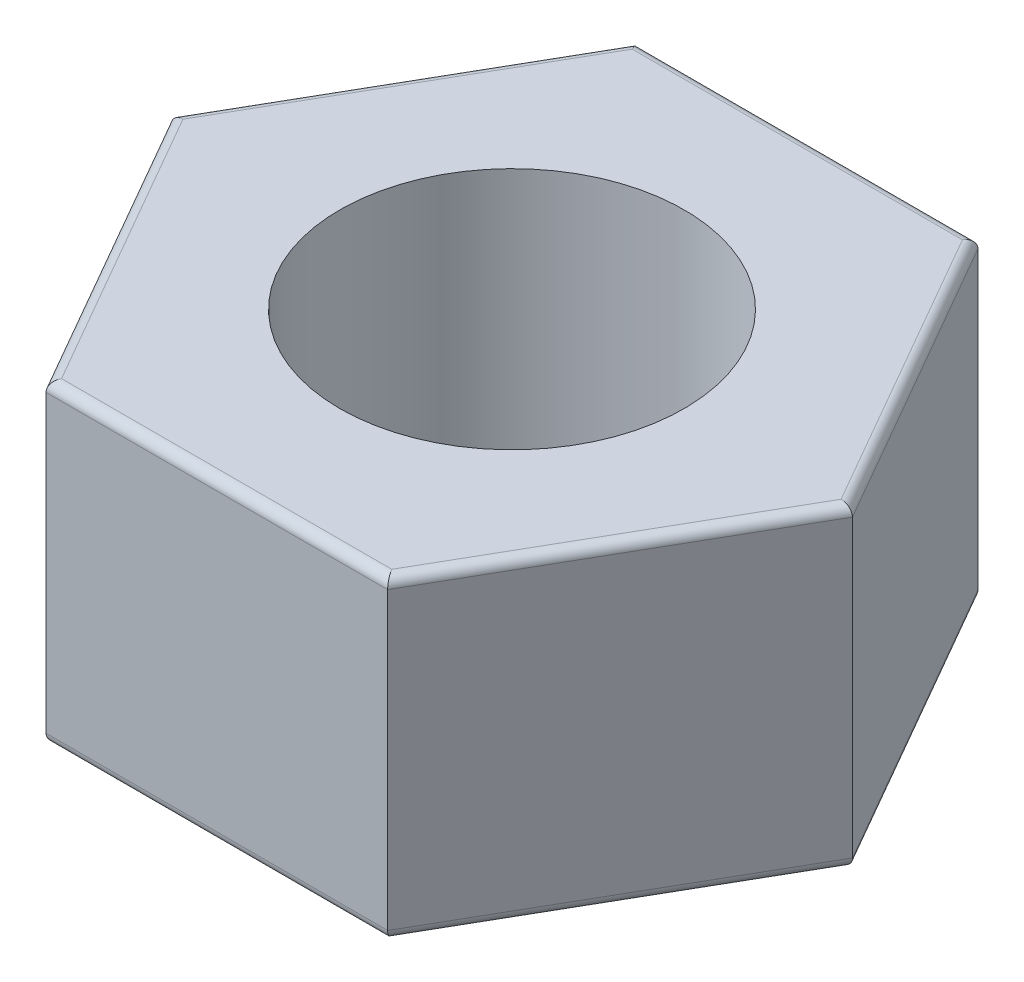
ISO-10303-21;
HEADER;
FILE_DESCRIPTION(('STEP AP214'),'2;1');
FILE_NAME('part.step','',(''),(''),'','','');
FILE_SCHEMA(('AUTOMOTIVE_DESIGN { 1 0 10303 214 1 1 1 1 }'));
ENDSEC;
DATA;
#1=APPLICATION_CONTEXT('core data for automotive mechanical design processes');
#2=APPLICATION_PROTOCOL_DEFINITION('international standard','automotive_design',2000,#1);
#3=PRODUCT_CONTEXT('',#1,'mechanical');
#4=PRODUCT('Part','Part','',(#3));
#5=PRODUCT_RELATED_PRODUCT_CATEGORY('part','',(#4));
#6=PRODUCT_DEFINITION_FORMATION('','',#4);
#7=PRODUCT_DEFINITION_CONTEXT('part definition',#1,'design');
#8=PRODUCT_DEFINITION('design','',#6,#7);
#9=PRODUCT_DEFINITION_SHAPE('','',#8);
#10=(LENGTH_UNIT() NAMED_UNIT(*) SI_UNIT(.MILLI.,.METRE.));
#11=(NAMED_UNIT(*) PLANE_ANGLE_UNIT() SI_UNIT($,.RADIAN.));
#12=(NAMED_UNIT(*) SI_UNIT($,.STERADIAN.) SOLID_ANGLE_UNIT());
#13=UNCERTAINTY_MEASURE_WITH_UNIT(LENGTH_MEASURE(1.E-05),#10,'distance_accuracy_value','');
#14=(GEOMETRIC_REPRESENTATION_CONTEXT(3) GLOBAL_UNCERTAINTY_ASSIGNED_CONTEXT((#13)) GLOBAL_UNIT_ASSIGNED_CONTEXT((#10,
#11,#12)) REPRESENTATION_CONTEXT('',''));
#15=CARTESIAN_POINT('',(0.,0.,0.));
#16=DIRECTION('',(0.,0.,1.));
#17=DIRECTION('',(1.,0.,0.));
#18=AXIS2_PLACEMENT_3D('',#15,#16,#17);
#19=CARTESIAN_POINT('',(8.68083530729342,16.,15.));
#20=DIRECTION('',(0.,1.,0.));
#21=DIRECTION('',(0.,0.,1.));
#22=AXIS2_PLACEMENT_3D('',#19,#20,#21);
#23=PLANE('',#22);
#24=DIRECTION('',(-0.498217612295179,0.,0.867052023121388));
#25=VECTOR('',#24,1.);
#26=CARTESIAN_POINT('',(-16.8664739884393,16.,0.249108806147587));
#27=LINE('',#26,#25);
#28=CARTESIAN_POINT('',(-8.39147413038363,16.,-14.5));
#29=VERTEX_POINT('',#28);
#30=CARTESIAN_POINT('',(-16.7233333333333,16.,0.));
#31=VERTEX_POINT('',#30);
#32=EDGE_CURVE('E38',#29,#31,#27,.T.);
#33=ORIENTED_EDGE('',*,*,#32,.T.);
#34=DIRECTION('',(0.498217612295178,0.,0.867052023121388));
#35=VECTOR('',#34,1.);
#36=CARTESIAN_POINT('',(-8.24730929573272,16.,14.7508911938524));
#37=LINE('',#36,#35);
#38=CARTESIAN_POINT('',(-8.39147413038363,16.,14.5));
#39=VERTEX_POINT('',#38);
#40=EDGE_CURVE('E11',#31,#39,#37,.T.);
#41=ORIENTED_EDGE('',*,*,#40,.T.);
#42=DIRECTION('',(1.,0.,0.));
#43=VECTOR('',#42,1.);
#44=CARTESIAN_POINT('',(8.68083530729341,16.,14.5));
#45=LINE('',#44,#43);
#46=CARTESIAN_POINT('',(8.39147413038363,16.,14.5));
#47=VERTEX_POINT('',#46);
#48=EDGE_CURVE('E152',#39,#47,#45,.T.);
#49=ORIENTED_EDGE('',*,*,#48,.T.);
#50=DIRECTION('',(0.498217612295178,0.,-0.867052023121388));
#51=VECTOR('',#50,1.);
#52=CARTESIAN_POINT('',(16.8664739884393,16.,-0.249108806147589));
#53=LINE('',#52,#51);
#54=CARTESIAN_POINT('',(16.7233333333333,16.,0.));
#55=VERTEX_POINT('',#54);
#56=EDGE_CURVE('E230',#47,#55,#53,.T.);
#57=ORIENTED_EDGE('',*,*,#56,.T.);
#58=DIRECTION('',(-0.498217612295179,0.,-0.867052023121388));
#59=VECTOR('',#58,1.);
#60=CARTESIAN_POINT('',(8.24730929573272,16.,-14.7508911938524));
#61=LINE('',#60,#59);
#62=CARTESIAN_POINT('',(8.39147413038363,16.,-14.5));
#63=VERTEX_POINT('',#62);
#64=EDGE_CURVE('E232',#55,#63,#61,.T.);
#65=ORIENTED_EDGE('',*,*,#64,.T.);
#66=DIRECTION('',(-1.,0.,0.));
#67=VECTOR('',#66,1.);
#68=CARTESIAN_POINT('',(-8.68083530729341,16.,-14.5));
#69=LINE('',#68,#67);
#70=EDGE_CURVE('E48',#63,#29,#69,.T.);
#71=ORIENTED_EDGE('',*,*,#70,.T.);
#72=EDGE_LOOP('',(#33,#41,#49,#57,#65,#71));
#73=FACE_BOUND('',#72,.T.);
#74=CARTESIAN_POINT('',(0.,16.,0.));
#75=DIRECTION('',(0.,1.,0.));
#76=DIRECTION('',(0.,0.,1.));
#77=AXIS2_PLACEMENT_3D('',#74,#75,#76);
#78=CIRCLE('',#77,8.75);
#79=CARTESIAN_POINT('',(0.,16.,8.75));
#80=VERTEX_POINT('',#79);
#81=EDGE_CURVE('E141',#80,#80,#78,.T.);
#82=ORIENTED_EDGE('',*,*,#81,.F.);
#83=EDGE_LOOP('',(#82));
#84=FACE_BOUND('',#83,.T.);
#85=ADVANCED_FACE('F30',(#73,#84),#23,.T.);
#86=CARTESIAN_POINT('',(8.68083530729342,0.,15.));
#87=DIRECTION('',(0.,1.,0.));
#88=DIRECTION('',(0.,0.,1.));
#89=AXIS2_PLACEMENT_3D('',#86,#87,#88);
#90=PLANE('',#89);
#91=DIRECTION('',(1.,0.,0.));
#92=VECTOR('',#91,1.);
#93=CARTESIAN_POINT('',(8.68083530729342,0.,14.5));
#94=LINE('',#93,#92);
#95=CARTESIAN_POINT('',(8.39147413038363,0.,14.5));
#96=VERTEX_POINT('',#95);
#97=CARTESIAN_POINT('',(-8.39147413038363,0.,14.5));
#98=VERTEX_POINT('',#97);
#99=EDGE_CURVE('E200',#96,#98,#94,.F.);
#100=ORIENTED_EDGE('',*,*,#99,.T.);
#101=DIRECTION('',(0.498217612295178,0.,0.867052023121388));
#102=VECTOR('',#101,1.);
#103=CARTESIAN_POINT('',(-3.93778171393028,0.,22.2507958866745));
#104=LINE('',#103,#102);
#105=CARTESIAN_POINT('',(-16.7233333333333,0.,0.));
#106=VERTEX_POINT('',#105);
#107=EDGE_CURVE('E210',#98,#106,#104,.F.);
#108=ORIENTED_EDGE('',*,*,#107,.T.);
#109=DIRECTION('',(-0.498217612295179,0.,0.867052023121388));
#110=VECTOR('',#109,1.);
#111=CARTESIAN_POINT('',(-16.8971993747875,0.,0.302580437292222));
#112=LINE('',#111,#110);
#113=CARTESIAN_POINT('',(-8.39147413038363,0.,-14.5));
#114=VERTEX_POINT('',#113);
#115=EDGE_CURVE('E208',#106,#114,#112,.F.);
#116=ORIENTED_EDGE('',*,*,#115,.T.);
#117=DIRECTION('',(-1.,0.,0.));
#118=VECTOR('',#117,1.);
#119=CARTESIAN_POINT('',(8.68083530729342,0.,-14.5));
#120=LINE('',#119,#118);
#121=CARTESIAN_POINT('',(8.39147413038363,0.,-14.5));
#122=VERTEX_POINT('',#121);
#123=EDGE_CURVE('E206',#114,#122,#120,.F.);
#124=ORIENTED_EDGE('',*,*,#123,.T.);
#125=DIRECTION('',(-0.498217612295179,0.,-0.867052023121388));
#126=VECTOR('',#125,1.);
#127=CARTESIAN_POINT('',(21.20672695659,0.,7.80248513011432));
#128=LINE('',#127,#126);
#129=CARTESIAN_POINT('',(16.7233333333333,0.,0.));
#130=VERTEX_POINT('',#129);
#131=EDGE_CURVE('E204',#122,#130,#128,.F.);
#132=ORIENTED_EDGE('',*,*,#131,.T.);
#133=DIRECTION('',(0.498217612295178,0.,-0.867052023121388));
#134=VECTOR('',#133,1.);
#135=CARTESIAN_POINT('',(8.24730929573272,0.,14.7508911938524));
#136=LINE('',#135,#134);
#137=EDGE_CURVE('E202',#130,#96,#136,.F.);
#138=ORIENTED_EDGE('',*,*,#137,.T.);
#139=EDGE_LOOP('',(#100,#108,#116,#124,#132,#138));
#140=FACE_BOUND('',#139,.T.);
#141=CARTESIAN_POINT('',(0.,0.,0.));
#142=DIRECTION('',(0.,1.,0.));
#143=DIRECTION('',(0.,0.,1.));
#144=AXIS2_PLACEMENT_3D('',#141,#142,#143);
#145=CIRCLE('',#144,8.75);
#146=CARTESIAN_POINT('',(0.,0.,8.75));
#147=VERTEX_POINT('',#146);
#148=EDGE_CURVE('E183',#147,#147,#145,.T.);
#149=ORIENTED_EDGE('',*,*,#148,.T.);
#150=EDGE_LOOP('',(#149));
#151=FACE_BOUND('',#150,.T.);
#152=ADVANCED_FACE('F270',(#140,#151),#90,.F.);
#153=CARTESIAN_POINT('',(-8.68083530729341,16.,15.));
#154=DIRECTION('',(0.,0.,-1.));
#155=DIRECTION('',(-1.,0.,0.));
#156=AXIS2_PLACEMENT_3D('',#153,#154,#155);
#157=PLANE('',#156);
#158=DIRECTION('',(0.,-1.,0.));
#159=VECTOR('',#158,1.);
#160=CARTESIAN_POINT('',(-8.68083530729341,16.,15.));
#161=LINE('',#160,#159);
#162=CARTESIAN_POINT('',(-8.68083530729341,15.5,15.));
#163=VERTEX_POINT('',#162);
#164=CARTESIAN_POINT('',(-8.68083530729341,0.5,15.));
#165=VERTEX_POINT('',#164);
#166=EDGE_CURVE('E120',#163,#165,#161,.T.);
#167=ORIENTED_EDGE('',*,*,#166,.T.);
#168=DIRECTION('',(1.,0.,0.));
#169=VECTOR('',#168,1.);
#170=CARTESIAN_POINT('',(-8.68083530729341,0.5,15.));
#171=LINE('',#170,#169);
#172=CARTESIAN_POINT('',(8.68083530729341,0.5,15.));
#173=VERTEX_POINT('',#172);
#174=EDGE_CURVE('E127',#165,#173,#171,.T.);
#175=ORIENTED_EDGE('',*,*,#174,.T.);
#176=DIRECTION('',(0.,-1.,0.));
#177=VECTOR('',#176,1.);
#178=CARTESIAN_POINT('',(8.68083530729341,16.,15.));
#179=LINE('',#178,#177);
#180=CARTESIAN_POINT('',(8.68083530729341,15.5,15.));
#181=VERTEX_POINT('',#180);
#182=EDGE_CURVE('E122',#181,#173,#179,.T.);
#183=ORIENTED_EDGE('',*,*,#182,.F.);
#184=DIRECTION('',(1.,0.,0.));
#185=VECTOR('',#184,1.);
#186=CARTESIAN_POINT('',(-8.68083530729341,15.5,15.));
#187=LINE('',#186,#185);
#188=EDGE_CURVE('E118',#181,#163,#187,.F.);
#189=ORIENTED_EDGE('',*,*,#188,.T.);
#190=EDGE_LOOP('',(#167,#175,#183,#189));
#191=FACE_BOUND('',#190,.T.);
#192=ADVANCED_FACE('F32',(#191),#157,.F.);
#193=CARTESIAN_POINT('',(8.68083530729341,16.,15.));
#194=DIRECTION('',(-0.867052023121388,0.,-0.498217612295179));
#195=DIRECTION('',(-0.498217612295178,0.,0.867052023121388));
#196=AXIS2_PLACEMENT_3D('',#193,#194,#195);
#197=PLANE('',#196);
#198=ORIENTED_EDGE('',*,*,#182,.T.);
#199=DIRECTION('',(0.498217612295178,0.,-0.867052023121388));
#200=VECTOR('',#199,1.);
#201=CARTESIAN_POINT('',(8.68083530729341,0.5,15.));
#202=LINE('',#201,#200);
#203=CARTESIAN_POINT('',(17.3,0.5,0.));
#204=VERTEX_POINT('',#203);
#205=EDGE_CURVE('E128',#173,#204,#202,.T.);
#206=ORIENTED_EDGE('',*,*,#205,.T.);
#207=DIRECTION('',(0.,-1.,0.));
#208=VECTOR('',#207,1.);
#209=CARTESIAN_POINT('',(17.3,16.,0.));
#210=LINE('',#209,#208);
#211=CARTESIAN_POINT('',(17.3,15.5,0.));
#212=VERTEX_POINT('',#211);
#213=EDGE_CURVE('E195',#212,#204,#210,.T.);
#214=ORIENTED_EDGE('',*,*,#213,.F.);
#215=DIRECTION('',(0.498217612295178,0.,-0.867052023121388));
#216=VECTOR('',#215,1.);
#217=CARTESIAN_POINT('',(8.68083530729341,15.5,15.));
#218=LINE('',#217,#216);
#219=EDGE_CURVE('E225',#212,#181,#218,.F.);
#220=ORIENTED_EDGE('',*,*,#219,.T.);
#221=EDGE_LOOP('',(#198,#206,#214,#220));
#222=FACE_BOUND('',#221,.T.);
#223=ADVANCED_FACE('F252',(#222),#197,.F.);
#224=CARTESIAN_POINT('',(8.68083530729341,16.,-15.));
#225=DIRECTION('',(-0.867052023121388,0.,0.498217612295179));
#226=DIRECTION('',(0.498217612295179,0.,0.867052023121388));
#227=AXIS2_PLACEMENT_3D('',#224,#225,#226);
#228=PLANE('',#227);
#229=ORIENTED_EDGE('',*,*,#213,.T.);
#230=DIRECTION('',(-0.498217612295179,0.,-0.867052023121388));
#231=VECTOR('',#230,1.);
#232=CARTESIAN_POINT('',(8.68083530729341,0.5,-15.));
#233=LINE('',#232,#231);
#234=CARTESIAN_POINT('',(8.68083530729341,0.5,-15.));
#235=VERTEX_POINT('',#234);
#236=EDGE_CURVE('E223',#204,#235,#233,.T.);
#237=ORIENTED_EDGE('',*,*,#236,.T.);
#238=DIRECTION('',(0.,-1.,0.));
#239=VECTOR('',#238,1.);
#240=CARTESIAN_POINT('',(8.68083530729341,16.,-15.));
#241=LINE('',#240,#239);
#242=CARTESIAN_POINT('',(8.68083530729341,15.5,-15.));
#243=VERTEX_POINT('',#242);
#244=EDGE_CURVE('E192',#243,#235,#241,.T.);
#245=ORIENTED_EDGE('',*,*,#244,.F.);
#246=DIRECTION('',(-0.498217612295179,0.,-0.867052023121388));
#247=VECTOR('',#246,1.);
#248=CARTESIAN_POINT('',(17.3,15.5,0.));
#249=LINE('',#248,#247);
#250=EDGE_CURVE('E221',#243,#212,#249,.F.);
#251=ORIENTED_EDGE('',*,*,#250,.T.);
#252=EDGE_LOOP('',(#229,#237,#245,#251));
#253=FACE_BOUND('',#252,.T.);
#254=ADVANCED_FACE('F256',(#253),#228,.F.);
#255=CARTESIAN_POINT('',(-8.68083530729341,16.,-15.));
#256=DIRECTION('',(0.,0.,1.));
#257=DIRECTION('',(1.,0.,0.));
#258=AXIS2_PLACEMENT_3D('',#255,#256,#257);
#259=PLANE('',#258);
#260=ORIENTED_EDGE('',*,*,#244,.T.);
#261=DIRECTION('',(-1.,0.,0.));
#262=VECTOR('',#261,1.);
#263=CARTESIAN_POINT('',(-8.68083530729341,0.5,-15.));
#264=LINE('',#263,#262);
#265=CARTESIAN_POINT('',(-8.68083530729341,0.5,-15.));
#266=VERTEX_POINT('',#265);
#267=EDGE_CURVE('E219',#235,#266,#264,.T.);
#268=ORIENTED_EDGE('',*,*,#267,.T.);
#269=DIRECTION('',(0.,-1.,0.));
#270=VECTOR('',#269,1.);
#271=CARTESIAN_POINT('',(-8.68083530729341,16.,-15.));
#272=LINE('',#271,#270);
#273=CARTESIAN_POINT('',(-8.68083530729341,15.5,-15.));
#274=VERTEX_POINT('',#273);
#275=EDGE_CURVE('E189',#274,#266,#272,.T.);
#276=ORIENTED_EDGE('',*,*,#275,.F.);
#277=DIRECTION('',(-1.,0.,0.));
#278=VECTOR('',#277,1.);
#279=CARTESIAN_POINT('',(8.68083530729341,15.5,-15.));
#280=LINE('',#279,#278);
#281=EDGE_CURVE('E217',#274,#243,#280,.F.);
#282=ORIENTED_EDGE('',*,*,#281,.T.);
#283=EDGE_LOOP('',(#260,#268,#276,#282));
#284=FACE_BOUND('',#283,.T.);
#285=ADVANCED_FACE('F280',(#284),#259,.F.);
#286=CARTESIAN_POINT('',(-8.68083530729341,16.,-15.));
#287=DIRECTION('',(0.867052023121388,0.,0.498217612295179));
#288=DIRECTION('',(0.498217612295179,0.,-0.867052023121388));
#289=AXIS2_PLACEMENT_3D('',#286,#287,#288);
#290=PLANE('',#289);
#291=ORIENTED_EDGE('',*,*,#275,.T.);
#292=DIRECTION('',(-0.498217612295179,0.,0.867052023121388));
#293=VECTOR('',#292,1.);
#294=CARTESIAN_POINT('',(-8.68083530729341,0.5,-15.));
#295=LINE('',#294,#293);
#296=CARTESIAN_POINT('',(-17.3,0.5,0.));
#297=VERTEX_POINT('',#296);
#298=EDGE_CURVE('E215',#266,#297,#295,.T.);
#299=ORIENTED_EDGE('',*,*,#298,.T.);
#300=DIRECTION('',(0.,-1.,0.));
#301=VECTOR('',#300,1.);
#302=CARTESIAN_POINT('',(-17.3,16.,0.));
#303=LINE('',#302,#301);
#304=CARTESIAN_POINT('',(-17.3,15.5,0.));
#305=VERTEX_POINT('',#304);
#306=EDGE_CURVE('E140',#305,#297,#303,.T.);
#307=ORIENTED_EDGE('',*,*,#306,.F.);
#308=DIRECTION('',(-0.498217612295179,0.,0.867052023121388));
#309=VECTOR('',#308,1.);
#310=CARTESIAN_POINT('',(-8.68083530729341,15.5,-15.));
#311=LINE('',#310,#309);
#312=EDGE_CURVE('E213',#305,#274,#311,.F.);
#313=ORIENTED_EDGE('',*,*,#312,.T.);
#314=EDGE_LOOP('',(#291,#299,#307,#313));
#315=FACE_BOUND('',#314,.T.);
#316=ADVANCED_FACE('F282',(#315),#290,.F.);
#317=CARTESIAN_POINT('',(-8.68083530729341,16.,15.));
#318=DIRECTION('',(0.867052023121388,0.,-0.498217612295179));
#319=DIRECTION('',(-0.498217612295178,0.,-0.867052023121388));
#320=AXIS2_PLACEMENT_3D('',#317,#318,#319);
#321=PLANE('',#320);
#322=ORIENTED_EDGE('',*,*,#306,.T.);
#323=DIRECTION('',(0.498217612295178,0.,0.867052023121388));
#324=VECTOR('',#323,1.);
#325=CARTESIAN_POINT('',(-8.68083530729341,0.5,15.));
#326=LINE('',#325,#324);
#327=EDGE_CURVE('E139',#297,#165,#326,.T.);
#328=ORIENTED_EDGE('',*,*,#327,.T.);
#329=ORIENTED_EDGE('',*,*,#166,.F.);
#330=DIRECTION('',(0.498217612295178,0.,0.867052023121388));
#331=VECTOR('',#330,1.);
#332=CARTESIAN_POINT('',(-17.3,15.5,0.));
#333=LINE('',#332,#331);
#334=EDGE_CURVE('E136',#163,#305,#333,.F.);
#335=ORIENTED_EDGE('',*,*,#334,.T.);
#336=EDGE_LOOP('',(#322,#328,#329,#335));
#337=FACE_BOUND('',#336,.T.);
#338=ADVANCED_FACE('F135',(#337),#321,.F.);
#339=CARTESIAN_POINT('',(0.,16.,0.));
#340=DIRECTION('',(0.,-1.,0.));
#341=DIRECTION('',(0.,0.,-1.));
#342=AXIS2_PLACEMENT_3D('',#339,#340,#341);
#343=CYLINDRICAL_SURFACE('',#342,8.75);
#344=ORIENTED_EDGE('',*,*,#81,.T.);
#345=EDGE_LOOP('',(#344));
#346=FACE_BOUND('',#345,.T.);
#347=ORIENTED_EDGE('',*,*,#148,.F.);
#348=EDGE_LOOP('',(#347));
#349=FACE_BOUND('',#348,.T.);
#350=ADVANCED_FACE('F311',(#346,#349),#343,.F.);
#351=CARTESIAN_POINT('',(8.24730929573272,0.5,-14.7508911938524));
#352=DIRECTION('',(-0.498217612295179,0.,-0.867052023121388));
#353=DIRECTION('',(-0.867052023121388,0.,0.498217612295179));
#354=AXIS2_PLACEMENT_3D('',#351,#352,#353);
#355=CYLINDRICAL_SURFACE('',#354,0.5);
#356=CARTESIAN_POINT('',(16.7233333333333,0.5,0.));
#357=DIRECTION('',(0.,0.,-1.));
#358=DIRECTION('',(1.,0.,0.));
#359=AXIS2_PLACEMENT_3D('',#356,#357,#358);
#360=ELLIPSE('',#359,0.576666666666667,0.5);
#361=EDGE_CURVE('E177',#130,#204,#360,.F.);
#362=ORIENTED_EDGE('',*,*,#361,.F.);
#363=ORIENTED_EDGE('',*,*,#131,.F.);
#364=CARTESIAN_POINT('',(8.39147413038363,0.5,-14.5));
#365=DIRECTION('',(-0.865510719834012,0.,-0.500890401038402));
#366=DIRECTION('',(0.500890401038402,0.,-0.865510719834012));
#367=AXIS2_PLACEMENT_3D('',#364,#365,#366);
#368=ELLIPSE('',#367,0.57769359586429,0.5);
#369=EDGE_CURVE('E180',#235,#122,#368,.T.);
#370=ORIENTED_EDGE('',*,*,#369,.F.);
#371=ORIENTED_EDGE('',*,*,#236,.F.);
#372=EDGE_LOOP('',(#362,#363,#370,#371));
#373=FACE_BOUND('',#372,.T.);
#374=ADVANCED_FACE('F261',(#373),#355,.T.);
#375=CARTESIAN_POINT('',(-8.68083530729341,0.5,-14.5));
#376=DIRECTION('',(-1.,0.,0.));
#377=DIRECTION('',(0.,0.,1.));
#378=AXIS2_PLACEMENT_3D('',#375,#376,#377);
#379=CYLINDRICAL_SURFACE('',#378,0.5);
#380=ORIENTED_EDGE('',*,*,#369,.T.);
#381=ORIENTED_EDGE('',*,*,#123,.F.);
#382=CARTESIAN_POINT('',(-8.39147413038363,0.5,-14.5));
#383=DIRECTION('',(-0.865510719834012,0.,0.500890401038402));
#384=DIRECTION('',(-0.500890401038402,0.,-0.865510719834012));
#385=AXIS2_PLACEMENT_3D('',#382,#383,#384);
#386=ELLIPSE('',#385,0.57769359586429,0.5);
#387=EDGE_CURVE('E174',#266,#114,#386,.T.);
#388=ORIENTED_EDGE('',*,*,#387,.F.);
#389=ORIENTED_EDGE('',*,*,#267,.F.);
#390=EDGE_LOOP('',(#380,#381,#388,#389));
#391=FACE_BOUND('',#390,.T.);
#392=ADVANCED_FACE('F275',(#391),#379,.T.);
#393=CARTESIAN_POINT('',(8.24730929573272,0.5,14.7508911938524));
#394=DIRECTION('',(0.498217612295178,0.,-0.867052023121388));
#395=DIRECTION('',(-0.867052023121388,0.,-0.498217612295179));
#396=AXIS2_PLACEMENT_3D('',#393,#394,#395);
#397=CYLINDRICAL_SURFACE('',#396,0.5);
#398=ORIENTED_EDGE('',*,*,#361,.T.);
#399=ORIENTED_EDGE('',*,*,#205,.F.);
#400=CARTESIAN_POINT('',(8.39147413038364,0.5,14.5));
#401=DIRECTION('',(0.865510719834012,0.,-0.500890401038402));
#402=DIRECTION('',(0.500890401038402,0.,0.865510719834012));
#403=AXIS2_PLACEMENT_3D('',#400,#401,#402);
#404=ELLIPSE('',#403,0.57769359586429,0.5);
#405=EDGE_CURVE('E171',#96,#173,#404,.F.);
#406=ORIENTED_EDGE('',*,*,#405,.F.);
#407=ORIENTED_EDGE('',*,*,#137,.F.);
#408=EDGE_LOOP('',(#398,#399,#406,#407));
#409=FACE_BOUND('',#408,.T.);
#410=ADVANCED_FACE('F266',(#409),#397,.T.);
#411=CARTESIAN_POINT('',(-8.24730929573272,0.5,-14.7508911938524));
#412=DIRECTION('',(-0.498217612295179,0.,0.867052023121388));
#413=DIRECTION('',(0.867052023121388,0.,0.498217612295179));
#414=AXIS2_PLACEMENT_3D('',#411,#412,#413);
#415=CYLINDRICAL_SURFACE('',#414,0.5);
#416=ORIENTED_EDGE('',*,*,#387,.T.);
#417=ORIENTED_EDGE('',*,*,#115,.F.);
#418=CARTESIAN_POINT('',(-16.7233333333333,0.5,0.));
#419=DIRECTION('',(0.,0.,1.));
#420=DIRECTION('',(-1.,0.,0.));
#421=AXIS2_PLACEMENT_3D('',#418,#419,#420);
#422=ELLIPSE('',#421,0.576666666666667,0.5);
#423=EDGE_CURVE('E169',#297,#106,#422,.T.);
#424=ORIENTED_EDGE('',*,*,#423,.F.);
#425=ORIENTED_EDGE('',*,*,#298,.F.);
#426=EDGE_LOOP('',(#416,#417,#424,#425));
#427=FACE_BOUND('',#426,.T.);
#428=ADVANCED_FACE('F286',(#427),#415,.T.);
#429=CARTESIAN_POINT('',(-8.68083530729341,0.5,14.5));
#430=DIRECTION('',(1.,0.,0.));
#431=DIRECTION('',(0.,0.,-1.));
#432=AXIS2_PLACEMENT_3D('',#429,#430,#431);
#433=CYLINDRICAL_SURFACE('',#432,0.5);
#434=ORIENTED_EDGE('',*,*,#405,.T.);
#435=ORIENTED_EDGE('',*,*,#174,.F.);
#436=CARTESIAN_POINT('',(-8.39147413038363,0.5,14.5));
#437=DIRECTION('',(0.865510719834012,0.,0.500890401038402));
#438=DIRECTION('',(0.500890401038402,0.,-0.865510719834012));
#439=AXIS2_PLACEMENT_3D('',#436,#437,#438);
#440=ELLIPSE('',#439,0.57769359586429,0.5);
#441=EDGE_CURVE('E167',#98,#165,#440,.F.);
#442=ORIENTED_EDGE('',*,*,#441,.F.);
#443=ORIENTED_EDGE('',*,*,#99,.F.);
#444=EDGE_LOOP('',(#434,#435,#442,#443));
#445=FACE_BOUND('',#444,.T.);
#446=ADVANCED_FACE('F292',(#445),#433,.T.);
#447=CARTESIAN_POINT('',(-8.24730929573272,0.5,14.7508911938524));
#448=DIRECTION('',(0.498217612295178,0.,0.867052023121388));
#449=DIRECTION('',(0.867052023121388,0.,-0.498217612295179));
#450=AXIS2_PLACEMENT_3D('',#447,#448,#449);
#451=CYLINDRICAL_SURFACE('',#450,0.5);
#452=ORIENTED_EDGE('',*,*,#423,.T.);
#453=ORIENTED_EDGE('',*,*,#107,.F.);
#454=ORIENTED_EDGE('',*,*,#441,.T.);
#455=ORIENTED_EDGE('',*,*,#327,.F.);
#456=EDGE_LOOP('',(#452,#453,#454,#455));
#457=FACE_BOUND('',#456,.T.);
#458=ADVANCED_FACE('F288',(#457),#451,.T.);
#459=CARTESIAN_POINT('',(21.20672695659,15.5,7.80248513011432));
#460=DIRECTION('',(0.498217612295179,0.,0.867052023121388));
#461=DIRECTION('',(0.867052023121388,0.,-0.498217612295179));
#462=AXIS2_PLACEMENT_3D('',#459,#460,#461);
#463=CYLINDRICAL_SURFACE('',#462,0.5);
#464=CARTESIAN_POINT('',(16.7233333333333,15.5,0.));
#465=DIRECTION('',(0.,0.,1.));
#466=DIRECTION('',(-1.,0.,0.));
#467=AXIS2_PLACEMENT_3D('',#464,#465,#466);
#468=ELLIPSE('',#467,0.576666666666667,0.5);
#469=EDGE_CURVE('E161',#212,#55,#468,.T.);
#470=ORIENTED_EDGE('',*,*,#469,.F.);
#471=ORIENTED_EDGE('',*,*,#250,.F.);
#472=CARTESIAN_POINT('',(8.39147413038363,15.5,-14.5));
#473=DIRECTION('',(0.865510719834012,0.,0.500890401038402));
#474=DIRECTION('',(-0.500890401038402,0.,0.865510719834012));
#475=AXIS2_PLACEMENT_3D('',#472,#473,#474);
#476=ELLIPSE('',#475,0.57769359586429,0.5);
#477=EDGE_CURVE('E164',#63,#243,#476,.F.);
#478=ORIENTED_EDGE('',*,*,#477,.F.);
#479=ORIENTED_EDGE('',*,*,#64,.F.);
#480=EDGE_LOOP('',(#470,#471,#478,#479));
#481=FACE_BOUND('',#480,.T.);
#482=ADVANCED_FACE('F241',(#481),#463,.T.);
#483=CARTESIAN_POINT('',(8.68083530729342,15.5,-14.5));
#484=DIRECTION('',(1.,0.,0.));
#485=DIRECTION('',(0.,0.,-1.));
#486=AXIS2_PLACEMENT_3D('',#483,#484,#485);
#487=CYLINDRICAL_SURFACE('',#486,0.5);
#488=ORIENTED_EDGE('',*,*,#477,.T.);
#489=ORIENTED_EDGE('',*,*,#281,.F.);
#490=CARTESIAN_POINT('',(-8.39147413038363,15.5,-14.5));
#491=DIRECTION('',(0.865510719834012,0.,-0.500890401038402));
#492=DIRECTION('',(0.500890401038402,0.,0.865510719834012));
#493=AXIS2_PLACEMENT_3D('',#490,#491,#492);
#494=ELLIPSE('',#493,0.57769359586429,0.5);
#495=EDGE_CURVE('E158',#29,#274,#494,.F.);
#496=ORIENTED_EDGE('',*,*,#495,.F.);
#497=ORIENTED_EDGE('',*,*,#70,.F.);
#498=EDGE_LOOP('',(#488,#489,#496,#497));
#499=FACE_BOUND('',#498,.T.);
#500=ADVANCED_FACE('F244',(#499),#487,.T.);
#501=CARTESIAN_POINT('',(8.24730929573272,15.5,14.7508911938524));
#502=DIRECTION('',(-0.498217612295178,0.,0.867052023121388));
#503=DIRECTION('',(0.867052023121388,0.,0.498217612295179));
#504=AXIS2_PLACEMENT_3D('',#501,#502,#503);
#505=CYLINDRICAL_SURFACE('',#504,0.5);
#506=ORIENTED_EDGE('',*,*,#469,.T.);
#507=ORIENTED_EDGE('',*,*,#56,.F.);
#508=CARTESIAN_POINT('',(8.39147413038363,15.5,14.5));
#509=DIRECTION('',(-0.865510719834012,0.,0.500890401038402));
#510=DIRECTION('',(-0.500890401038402,0.,-0.865510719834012));
#511=AXIS2_PLACEMENT_3D('',#508,#509,#510);
#512=ELLIPSE('',#511,0.57769359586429,0.5);
#513=EDGE_CURVE('E154',#181,#47,#512,.T.);
#514=ORIENTED_EDGE('',*,*,#513,.F.);
#515=ORIENTED_EDGE('',*,*,#219,.F.);
#516=EDGE_LOOP('',(#506,#507,#514,#515));
#517=FACE_BOUND('',#516,.T.);
#518=ADVANCED_FACE('F248',(#517),#505,.T.);
#519=CARTESIAN_POINT('',(-16.8971993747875,15.5,0.302580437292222));
#520=DIRECTION('',(0.498217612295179,0.,-0.867052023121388));
#521=DIRECTION('',(-0.867052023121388,0.,-0.498217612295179));
#522=AXIS2_PLACEMENT_3D('',#519,#520,#521);
#523=CYLINDRICAL_SURFACE('',#522,0.5);
#524=ORIENTED_EDGE('',*,*,#495,.T.);
#525=ORIENTED_EDGE('',*,*,#312,.F.);
#526=CARTESIAN_POINT('',(-16.7233333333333,15.5,0.));
#527=DIRECTION('',(0.,0.,-1.));
#528=DIRECTION('',(1.,0.,0.));
#529=AXIS2_PLACEMENT_3D('',#526,#527,#528);
#530=ELLIPSE('',#529,0.576666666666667,0.5);
#531=EDGE_CURVE('E148',#31,#305,#530,.F.);
#532=ORIENTED_EDGE('',*,*,#531,.F.);
#533=ORIENTED_EDGE('',*,*,#32,.F.);
#534=EDGE_LOOP('',(#524,#525,#532,#533));
#535=FACE_BOUND('',#534,.T.);
#536=ADVANCED_FACE('F246',(#535),#523,.T.);
#537=CARTESIAN_POINT('',(8.68083530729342,15.5,14.5));
#538=DIRECTION('',(-1.,0.,0.));
#539=DIRECTION('',(0.,0.,1.));
#540=AXIS2_PLACEMENT_3D('',#537,#538,#539);
#541=CYLINDRICAL_SURFACE('',#540,0.5);
#542=ORIENTED_EDGE('',*,*,#513,.T.);
#543=ORIENTED_EDGE('',*,*,#48,.F.);
#544=CARTESIAN_POINT('',(-8.39147413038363,15.5,14.5));
#545=DIRECTION('',(-0.865510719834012,0.,-0.500890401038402));
#546=DIRECTION('',(-0.500890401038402,0.,0.865510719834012));
#547=AXIS2_PLACEMENT_3D('',#544,#545,#546);
#548=ELLIPSE('',#547,0.57769359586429,0.5);
#549=EDGE_CURVE('E146',#163,#39,#548,.T.);
#550=ORIENTED_EDGE('',*,*,#549,.F.);
#551=ORIENTED_EDGE('',*,*,#188,.F.);
#552=EDGE_LOOP('',(#542,#543,#550,#551));
#553=FACE_BOUND('',#552,.T.);
#554=ADVANCED_FACE('F151',(#553),#541,.T.);
#555=CARTESIAN_POINT('',(-3.93778171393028,15.5,22.2507958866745));
#556=DIRECTION('',(-0.498217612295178,0.,-0.867052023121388));
#557=DIRECTION('',(-0.867052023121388,0.,0.498217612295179));
#558=AXIS2_PLACEMENT_3D('',#555,#556,#557);
#559=CYLINDRICAL_SURFACE('',#558,0.5);
#560=ORIENTED_EDGE('',*,*,#531,.T.);
#561=ORIENTED_EDGE('',*,*,#334,.F.);
#562=ORIENTED_EDGE('',*,*,#549,.T.);
#563=ORIENTED_EDGE('',*,*,#40,.F.);
#564=EDGE_LOOP('',(#560,#561,#562,#563));
#565=FACE_BOUND('',#564,.T.);
#566=ADVANCED_FACE('F144',(#565),#559,.T.);
#567=CLOSED_SHELL('',(#85,#152,#192,#223,#254,#285,#316,#338,#350,#374,#392,#410,#428,#446,#458,
#482,#500,#518,#536,#554,#566));
#568=MANIFOLD_SOLID_BREP('B2',#567);
#569=ADVANCED_BREP_SHAPE_REPRESENTATION('',(#18,#568),#14);
#570=SHAPE_DEFINITION_REPRESENTATION(#9,#569);
ENDSEC;
END-ISO-10303-21;
